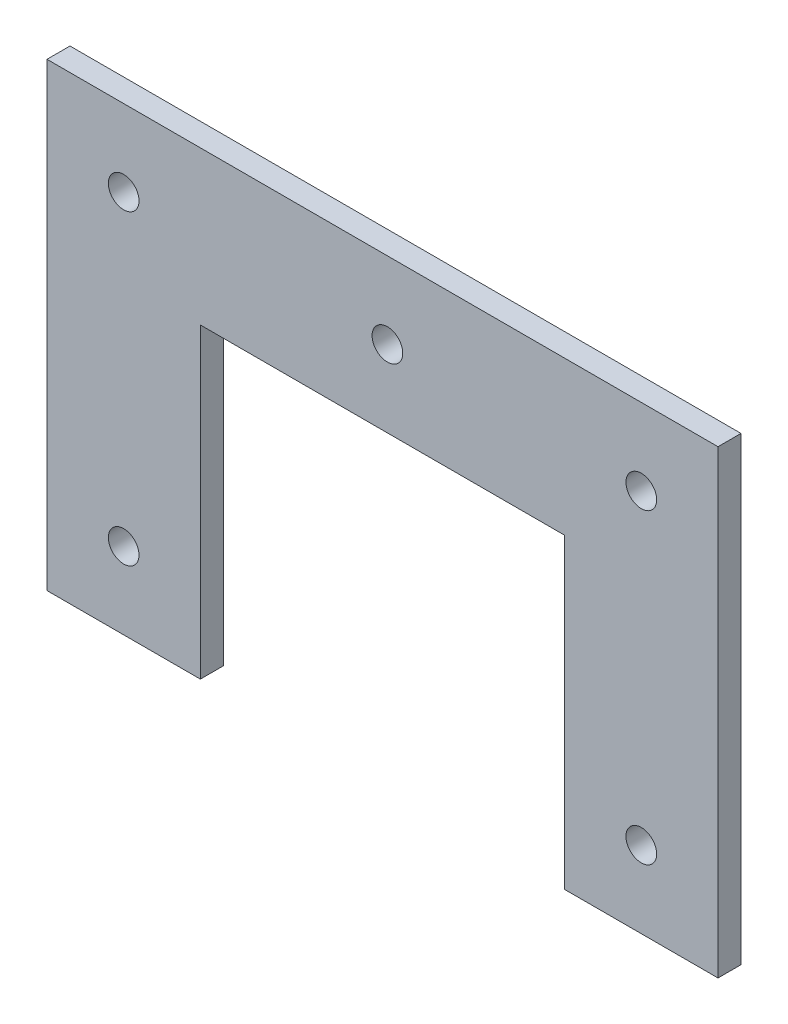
ISO-10303-21;
HEADER;
FILE_DESCRIPTION(('STEP AP214'),'2;1');
FILE_NAME('part.step','',(''),(''),'','','');
FILE_SCHEMA(('AUTOMOTIVE_DESIGN { 1 0 10303 214 1 1 1 1 }'));
ENDSEC;
DATA;
#1=APPLICATION_CONTEXT('core data for automotive mechanical design processes');
#2=APPLICATION_PROTOCOL_DEFINITION('international standard','automotive_design',2000,#1);
#3=PRODUCT_CONTEXT('',#1,'mechanical');
#4=PRODUCT('Part','Part','',(#3));
#5=PRODUCT_RELATED_PRODUCT_CATEGORY('part','',(#4));
#6=PRODUCT_DEFINITION_FORMATION('','',#4);
#7=PRODUCT_DEFINITION_CONTEXT('part definition',#1,'design');
#8=PRODUCT_DEFINITION('design','',#6,#7);
#9=PRODUCT_DEFINITION_SHAPE('','',#8);
#10=(LENGTH_UNIT() NAMED_UNIT(*) SI_UNIT(.MILLI.,.METRE.));
#11=(NAMED_UNIT(*) PLANE_ANGLE_UNIT() SI_UNIT($,.RADIAN.));
#12=(NAMED_UNIT(*) SI_UNIT($,.STERADIAN.) SOLID_ANGLE_UNIT());
#13=UNCERTAINTY_MEASURE_WITH_UNIT(LENGTH_MEASURE(1.E-05),#10,'distance_accuracy_value','');
#14=(GEOMETRIC_REPRESENTATION_CONTEXT(3) GLOBAL_UNCERTAINTY_ASSIGNED_CONTEXT((#13)) GLOBAL_UNIT_ASSIGNED_CONTEXT((#10,
#11,#12)) REPRESENTATION_CONTEXT('',''));
#15=CARTESIAN_POINT('',(0.,0.,0.));
#16=DIRECTION('',(0.,0.,1.));
#17=DIRECTION('',(1.,0.,0.));
#18=AXIS2_PLACEMENT_3D('',#15,#16,#17);
#19=CARTESIAN_POINT('',(-43.75,-30.,3.));
#20=DIRECTION('',(0.,1.,0.));
#21=DIRECTION('',(0.,0.,1.));
#22=AXIS2_PLACEMENT_3D('',#19,#20,#21);
#23=PLANE('',#22);
#24=DIRECTION('',(1.,0.,0.));
#25=VECTOR('',#24,1.);
#26=CARTESIAN_POINT('',(-43.75,-30.,0.));
#27=LINE('',#26,#25);
#28=CARTESIAN_POINT('',(-43.75,-30.,0.));
#29=VERTEX_POINT('',#28);
#30=CARTESIAN_POINT('',(-23.75,-30.,0.));
#31=VERTEX_POINT('',#30);
#32=EDGE_CURVE('E126',#29,#31,#27,.T.);
#33=ORIENTED_EDGE('',*,*,#32,.T.);
#34=DIRECTION('',(0.,0.,1.));
#35=VECTOR('',#34,1.);
#36=CARTESIAN_POINT('',(-23.75,-30.,0.));
#37=LINE('',#36,#35);
#38=CARTESIAN_POINT('',(-23.75,-30.,3.));
#39=VERTEX_POINT('',#38);
#40=EDGE_CURVE('E110',#31,#39,#37,.T.);
#41=ORIENTED_EDGE('',*,*,#40,.T.);
#42=DIRECTION('',(1.,0.,0.));
#43=VECTOR('',#42,1.);
#44=CARTESIAN_POINT('',(-43.75,-30.,3.));
#45=LINE('',#44,#43);
#46=CARTESIAN_POINT('',(-43.75,-30.,3.));
#47=VERTEX_POINT('',#46);
#48=EDGE_CURVE('E143',#47,#39,#45,.T.);
#49=ORIENTED_EDGE('',*,*,#48,.F.);
#50=DIRECTION('',(0.,0.,-1.));
#51=VECTOR('',#50,1.);
#52=CARTESIAN_POINT('',(-43.75,-30.,3.));
#53=LINE('',#52,#51);
#54=EDGE_CURVE('E133',#47,#29,#53,.T.);
#55=ORIENTED_EDGE('',*,*,#54,.T.);
#56=EDGE_LOOP('',(#33,#41,#49,#55));
#57=FACE_BOUND('',#56,.T.);
#58=ADVANCED_FACE('F35',(#57),#23,.F.);
#59=CARTESIAN_POINT('',(43.75,30.,3.));
#60=DIRECTION('',(-1.,0.,0.));
#61=DIRECTION('',(0.,-1.,0.));
#62=AXIS2_PLACEMENT_3D('',#59,#60,#61);
#63=PLANE('',#62);
#64=DIRECTION('',(0.,1.,0.));
#65=VECTOR('',#64,1.);
#66=CARTESIAN_POINT('',(43.75,30.,0.));
#67=LINE('',#66,#65);
#68=CARTESIAN_POINT('',(43.75,-30.,0.));
#69=VERTEX_POINT('',#68);
#70=CARTESIAN_POINT('',(43.75,30.,0.));
#71=VERTEX_POINT('',#70);
#72=EDGE_CURVE('E151',#69,#71,#67,.T.);
#73=ORIENTED_EDGE('',*,*,#72,.T.);
#74=DIRECTION('',(0.,0.,-1.));
#75=VECTOR('',#74,1.);
#76=CARTESIAN_POINT('',(43.75,30.,3.));
#77=LINE('',#76,#75);
#78=CARTESIAN_POINT('',(43.75,30.,3.));
#79=VERTEX_POINT('',#78);
#80=EDGE_CURVE('E11',#79,#71,#77,.T.);
#81=ORIENTED_EDGE('',*,*,#80,.F.);
#82=DIRECTION('',(0.,1.,0.));
#83=VECTOR('',#82,1.);
#84=CARTESIAN_POINT('',(43.75,30.,3.));
#85=LINE('',#84,#83);
#86=CARTESIAN_POINT('',(43.75,-30.,3.));
#87=VERTEX_POINT('',#86);
#88=EDGE_CURVE('E134',#87,#79,#85,.T.);
#89=ORIENTED_EDGE('',*,*,#88,.F.);
#90=DIRECTION('',(0.,0.,-1.));
#91=VECTOR('',#90,1.);
#92=CARTESIAN_POINT('',(43.75,-30.,3.));
#93=LINE('',#92,#91);
#94=EDGE_CURVE('E141',#87,#69,#93,.T.);
#95=ORIENTED_EDGE('',*,*,#94,.T.);
#96=EDGE_LOOP('',(#73,#81,#89,#95));
#97=FACE_BOUND('',#96,.T.);
#98=ADVANCED_FACE('F37',(#97),#63,.F.);
#99=CARTESIAN_POINT('',(-43.75,30.,3.));
#100=DIRECTION('',(0.,-1.,0.));
#101=DIRECTION('',(0.,0.,-1.));
#102=AXIS2_PLACEMENT_3D('',#99,#100,#101);
#103=PLANE('',#102);
#104=DIRECTION('',(-1.,0.,0.));
#105=VECTOR('',#104,1.);
#106=CARTESIAN_POINT('',(-43.75,30.,0.));
#107=LINE('',#106,#105);
#108=CARTESIAN_POINT('',(-43.75,30.,0.));
#109=VERTEX_POINT('',#108);
#110=EDGE_CURVE('E150',#71,#109,#107,.T.);
#111=ORIENTED_EDGE('',*,*,#110,.T.);
#112=DIRECTION('',(0.,0.,-1.));
#113=VECTOR('',#112,1.);
#114=CARTESIAN_POINT('',(-43.75,30.,3.));
#115=LINE('',#114,#113);
#116=CARTESIAN_POINT('',(-43.75,30.,3.));
#117=VERTEX_POINT('',#116);
#118=EDGE_CURVE('E43',#117,#109,#115,.T.);
#119=ORIENTED_EDGE('',*,*,#118,.F.);
#120=DIRECTION('',(-1.,0.,0.));
#121=VECTOR('',#120,1.);
#122=CARTESIAN_POINT('',(-43.75,30.,3.));
#123=LINE('',#122,#121);
#124=EDGE_CURVE('E88',#79,#117,#123,.T.);
#125=ORIENTED_EDGE('',*,*,#124,.F.);
#126=ORIENTED_EDGE('',*,*,#80,.T.);
#127=EDGE_LOOP('',(#111,#119,#125,#126));
#128=FACE_BOUND('',#127,.T.);
#129=ADVANCED_FACE('F220',(#128),#103,.F.);
#130=CARTESIAN_POINT('',(-43.75,30.,3.));
#131=DIRECTION('',(1.,0.,0.));
#132=DIRECTION('',(0.,1.,0.));
#133=AXIS2_PLACEMENT_3D('',#130,#131,#132);
#134=PLANE('',#133);
#135=DIRECTION('',(0.,-1.,0.));
#136=VECTOR('',#135,1.);
#137=CARTESIAN_POINT('',(-43.75,30.,0.));
#138=LINE('',#137,#136);
#139=EDGE_CURVE('E137',#109,#29,#138,.T.);
#140=ORIENTED_EDGE('',*,*,#139,.T.);
#141=ORIENTED_EDGE('',*,*,#54,.F.);
#142=DIRECTION('',(0.,-1.,0.));
#143=VECTOR('',#142,1.);
#144=CARTESIAN_POINT('',(-43.75,30.,3.));
#145=LINE('',#144,#143);
#146=EDGE_CURVE('E148',#117,#47,#145,.T.);
#147=ORIENTED_EDGE('',*,*,#146,.F.);
#148=ORIENTED_EDGE('',*,*,#118,.T.);
#149=EDGE_LOOP('',(#140,#141,#147,#148));
#150=FACE_BOUND('',#149,.T.);
#151=ADVANCED_FACE('F147',(#150),#134,.F.);
#152=CARTESIAN_POINT('',(23.75,-30.,3.));
#153=VERTEX_POINT('',#152);
#154=EDGE_CURVE('E59',#153,#87,#45,.T.);
#155=ORIENTED_EDGE('',*,*,#154,.F.);
#156=DIRECTION('',(0.,0.,1.));
#157=VECTOR('',#156,1.);
#158=CARTESIAN_POINT('',(23.75,-30.,0.));
#159=LINE('',#158,#157);
#160=CARTESIAN_POINT('',(23.75,-30.,0.));
#161=VERTEX_POINT('',#160);
#162=EDGE_CURVE('E120',#161,#153,#159,.T.);
#163=ORIENTED_EDGE('',*,*,#162,.F.);
#164=EDGE_CURVE('E81',#161,#69,#27,.T.);
#165=ORIENTED_EDGE('',*,*,#164,.T.);
#166=ORIENTED_EDGE('',*,*,#94,.F.);
#167=EDGE_LOOP('',(#155,#163,#165,#166));
#168=FACE_BOUND('',#167,.T.);
#169=ADVANCED_FACE('F207',(#168),#23,.F.);
#170=CARTESIAN_POINT('',(0.,0.,3.));
#171=DIRECTION('',(0.,0.,1.));
#172=DIRECTION('',(1.,0.,0.));
#173=AXIS2_PLACEMENT_3D('',#170,#171,#172);
#174=PLANE('',#173);
#175=CARTESIAN_POINT('',(-33.75,-20.,3.));
#176=DIRECTION('',(0.,0.,1.));
#177=DIRECTION('',(1.,0.,0.));
#178=AXIS2_PLACEMENT_3D('',#175,#176,#177);
#179=CIRCLE('',#178,1.99999999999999);
#180=CARTESIAN_POINT('',(-31.75,-20.,3.));
#181=VERTEX_POINT('',#180);
#182=EDGE_CURVE('E198',#181,#181,#179,.T.);
#183=ORIENTED_EDGE('',*,*,#182,.F.);
#184=EDGE_LOOP('',(#183));
#185=FACE_BOUND('',#184,.T.);
#186=CARTESIAN_POINT('',(-33.75,20.,3.));
#187=DIRECTION('',(0.,0.,1.));
#188=DIRECTION('',(1.,0.,0.));
#189=AXIS2_PLACEMENT_3D('',#186,#187,#188);
#190=CIRCLE('',#189,1.99999999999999);
#191=CARTESIAN_POINT('',(-31.75,20.,3.));
#192=VERTEX_POINT('',#191);
#193=EDGE_CURVE('E192',#192,#192,#190,.T.);
#194=ORIENTED_EDGE('',*,*,#193,.F.);
#195=EDGE_LOOP('',(#194));
#196=FACE_BOUND('',#195,.T.);
#197=CARTESIAN_POINT('',(0.640947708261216,20.,3.));
#198=DIRECTION('',(0.,0.,1.));
#199=DIRECTION('',(1.,0.,0.));
#200=AXIS2_PLACEMENT_3D('',#197,#198,#199);
#201=CIRCLE('',#200,1.99999999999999);
#202=CARTESIAN_POINT('',(2.6409477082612,20.,3.));
#203=VERTEX_POINT('',#202);
#204=EDGE_CURVE('E186',#203,#203,#201,.T.);
#205=ORIENTED_EDGE('',*,*,#204,.F.);
#206=EDGE_LOOP('',(#205));
#207=FACE_BOUND('',#206,.T.);
#208=CARTESIAN_POINT('',(33.75,20.,3.));
#209=DIRECTION('',(0.,0.,1.));
#210=DIRECTION('',(1.,0.,0.));
#211=AXIS2_PLACEMENT_3D('',#208,#209,#210);
#212=CIRCLE('',#211,1.99999999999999);
#213=CARTESIAN_POINT('',(35.75,20.,3.));
#214=VERTEX_POINT('',#213);
#215=EDGE_CURVE('E180',#214,#214,#212,.T.);
#216=ORIENTED_EDGE('',*,*,#215,.F.);
#217=EDGE_LOOP('',(#216));
#218=FACE_BOUND('',#217,.T.);
#219=CARTESIAN_POINT('',(33.75,-20.,3.));
#220=DIRECTION('',(0.,0.,1.));
#221=DIRECTION('',(1.,0.,0.));
#222=AXIS2_PLACEMENT_3D('',#219,#220,#221);
#223=CIRCLE('',#222,1.99999999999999);
#224=CARTESIAN_POINT('',(35.75,-20.,3.));
#225=VERTEX_POINT('',#224);
#226=EDGE_CURVE('E174',#225,#225,#223,.T.);
#227=ORIENTED_EDGE('',*,*,#226,.F.);
#228=EDGE_LOOP('',(#227));
#229=FACE_BOUND('',#228,.T.);
#230=DIRECTION('',(0.,-1.,0.));
#231=VECTOR('',#230,1.);
#232=CARTESIAN_POINT('',(-23.75,-30.,3.));
#233=LINE('',#232,#231);
#234=CARTESIAN_POINT('',(-23.75,9.99999999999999,3.));
#235=VERTEX_POINT('',#234);
#236=EDGE_CURVE('E115',#235,#39,#233,.T.);
#237=ORIENTED_EDGE('',*,*,#236,.F.);
#238=DIRECTION('',(-1.,0.,0.));
#239=VECTOR('',#238,1.);
#240=CARTESIAN_POINT('',(-23.75,9.99999999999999,3.));
#241=LINE('',#240,#239);
#242=CARTESIAN_POINT('',(23.75,9.99999999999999,3.));
#243=VERTEX_POINT('',#242);
#244=EDGE_CURVE('E129',#243,#235,#241,.T.);
#245=ORIENTED_EDGE('',*,*,#244,.F.);
#246=DIRECTION('',(0.,1.,0.));
#247=VECTOR('',#246,1.);
#248=CARTESIAN_POINT('',(23.75,-30.,3.));
#249=LINE('',#248,#247);
#250=EDGE_CURVE('E165',#153,#243,#249,.T.);
#251=ORIENTED_EDGE('',*,*,#250,.F.);
#252=ORIENTED_EDGE('',*,*,#154,.T.);
#253=ORIENTED_EDGE('',*,*,#88,.T.);
#254=ORIENTED_EDGE('',*,*,#124,.T.);
#255=ORIENTED_EDGE('',*,*,#146,.T.);
#256=ORIENTED_EDGE('',*,*,#48,.T.);
#257=EDGE_LOOP('',(#237,#245,#251,#252,#253,#254,#255,#256));
#258=FACE_BOUND('',#257,.T.);
#259=ADVANCED_FACE('F204',(#185,#196,#207,#218,#229,#258),#174,.T.);
#260=CARTESIAN_POINT('',(0.,0.,0.));
#261=DIRECTION('',(0.,0.,1.));
#262=DIRECTION('',(1.,0.,0.));
#263=AXIS2_PLACEMENT_3D('',#260,#261,#262);
#264=PLANE('',#263);
#265=CARTESIAN_POINT('',(-33.75,-20.,0.));
#266=DIRECTION('',(0.,0.,1.));
#267=DIRECTION('',(1.,0.,0.));
#268=AXIS2_PLACEMENT_3D('',#265,#266,#267);
#269=CIRCLE('',#268,1.99999999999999);
#270=CARTESIAN_POINT('',(-31.75,-20.,0.));
#271=VERTEX_POINT('',#270);
#272=EDGE_CURVE('E195',#271,#271,#269,.T.);
#273=ORIENTED_EDGE('',*,*,#272,.T.);
#274=EDGE_LOOP('',(#273));
#275=FACE_BOUND('',#274,.T.);
#276=CARTESIAN_POINT('',(-33.75,20.,0.));
#277=DIRECTION('',(0.,0.,1.));
#278=DIRECTION('',(1.,0.,0.));
#279=AXIS2_PLACEMENT_3D('',#276,#277,#278);
#280=CIRCLE('',#279,1.99999999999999);
#281=CARTESIAN_POINT('',(-31.75,20.,0.));
#282=VERTEX_POINT('',#281);
#283=EDGE_CURVE('E189',#282,#282,#280,.T.);
#284=ORIENTED_EDGE('',*,*,#283,.T.);
#285=EDGE_LOOP('',(#284));
#286=FACE_BOUND('',#285,.T.);
#287=CARTESIAN_POINT('',(0.640947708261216,20.,0.));
#288=DIRECTION('',(0.,0.,1.));
#289=DIRECTION('',(1.,0.,0.));
#290=AXIS2_PLACEMENT_3D('',#287,#288,#289);
#291=CIRCLE('',#290,2.);
#292=CARTESIAN_POINT('',(2.64094770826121,20.,0.));
#293=VERTEX_POINT('',#292);
#294=EDGE_CURVE('E183',#293,#293,#291,.T.);
#295=ORIENTED_EDGE('',*,*,#294,.T.);
#296=EDGE_LOOP('',(#295));
#297=FACE_BOUND('',#296,.T.);
#298=CARTESIAN_POINT('',(33.75,20.,0.));
#299=DIRECTION('',(0.,0.,1.));
#300=DIRECTION('',(1.,0.,0.));
#301=AXIS2_PLACEMENT_3D('',#298,#299,#300);
#302=CIRCLE('',#301,1.99999999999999);
#303=CARTESIAN_POINT('',(35.75,20.,0.));
#304=VERTEX_POINT('',#303);
#305=EDGE_CURVE('E177',#304,#304,#302,.T.);
#306=ORIENTED_EDGE('',*,*,#305,.T.);
#307=EDGE_LOOP('',(#306));
#308=FACE_BOUND('',#307,.T.);
#309=CARTESIAN_POINT('',(33.75,-20.,0.));
#310=DIRECTION('',(0.,0.,1.));
#311=DIRECTION('',(1.,0.,0.));
#312=AXIS2_PLACEMENT_3D('',#309,#310,#311);
#313=CIRCLE('',#312,1.99999999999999);
#314=CARTESIAN_POINT('',(35.75,-20.,0.));
#315=VERTEX_POINT('',#314);
#316=EDGE_CURVE('E169',#315,#315,#313,.T.);
#317=ORIENTED_EDGE('',*,*,#316,.T.);
#318=EDGE_LOOP('',(#317));
#319=FACE_BOUND('',#318,.T.);
#320=DIRECTION('',(-1.,0.,0.));
#321=VECTOR('',#320,1.);
#322=CARTESIAN_POINT('',(-23.75,9.99999999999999,0.));
#323=LINE('',#322,#321);
#324=CARTESIAN_POINT('',(23.75,9.99999999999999,0.));
#325=VERTEX_POINT('',#324);
#326=CARTESIAN_POINT('',(-23.75,9.99999999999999,0.));
#327=VERTEX_POINT('',#326);
#328=EDGE_CURVE('E50',#325,#327,#323,.T.);
#329=ORIENTED_EDGE('',*,*,#328,.T.);
#330=DIRECTION('',(0.,-1.,0.));
#331=VECTOR('',#330,1.);
#332=CARTESIAN_POINT('',(-23.75,-30.,0.));
#333=LINE('',#332,#331);
#334=EDGE_CURVE('E113',#327,#31,#333,.T.);
#335=ORIENTED_EDGE('',*,*,#334,.T.);
#336=ORIENTED_EDGE('',*,*,#32,.F.);
#337=ORIENTED_EDGE('',*,*,#139,.F.);
#338=ORIENTED_EDGE('',*,*,#110,.F.);
#339=ORIENTED_EDGE('',*,*,#72,.F.);
#340=ORIENTED_EDGE('',*,*,#164,.F.);
#341=DIRECTION('',(0.,1.,0.));
#342=VECTOR('',#341,1.);
#343=CARTESIAN_POINT('',(23.75,-30.,0.));
#344=LINE('',#343,#342);
#345=EDGE_CURVE('E128',#161,#325,#344,.T.);
#346=ORIENTED_EDGE('',*,*,#345,.T.);
#347=EDGE_LOOP('',(#329,#335,#336,#337,#338,#339,#340,#346));
#348=FACE_BOUND('',#347,.T.);
#349=ADVANCED_FACE('F124',(#275,#286,#297,#308,#319,#348),#264,.F.);
#350=CARTESIAN_POINT('',(-23.75,-30.,0.));
#351=DIRECTION('',(-1.,0.,0.));
#352=DIRECTION('',(0.,0.,1.));
#353=AXIS2_PLACEMENT_3D('',#350,#351,#352);
#354=PLANE('',#353);
#355=ORIENTED_EDGE('',*,*,#236,.T.);
#356=ORIENTED_EDGE('',*,*,#40,.F.);
#357=ORIENTED_EDGE('',*,*,#334,.F.);
#358=DIRECTION('',(0.,0.,1.));
#359=VECTOR('',#358,1.);
#360=CARTESIAN_POINT('',(-23.75,9.99999999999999,0.));
#361=LINE('',#360,#359);
#362=EDGE_CURVE('E153',#327,#235,#361,.T.);
#363=ORIENTED_EDGE('',*,*,#362,.T.);
#364=EDGE_LOOP('',(#355,#356,#357,#363));
#365=FACE_BOUND('',#364,.T.);
#366=ADVANCED_FACE('F112',(#365),#354,.F.);
#367=CARTESIAN_POINT('',(-23.75,9.99999999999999,0.));
#368=DIRECTION('',(0.,1.,0.));
#369=DIRECTION('',(-1.,0.,0.));
#370=AXIS2_PLACEMENT_3D('',#367,#368,#369);
#371=PLANE('',#370);
#372=ORIENTED_EDGE('',*,*,#244,.T.);
#373=ORIENTED_EDGE('',*,*,#362,.F.);
#374=ORIENTED_EDGE('',*,*,#328,.F.);
#375=DIRECTION('',(0.,0.,1.));
#376=VECTOR('',#375,1.);
#377=CARTESIAN_POINT('',(23.75,9.99999999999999,0.));
#378=LINE('',#377,#376);
#379=EDGE_CURVE('E160',#325,#243,#378,.T.);
#380=ORIENTED_EDGE('',*,*,#379,.T.);
#381=EDGE_LOOP('',(#372,#373,#374,#380));
#382=FACE_BOUND('',#381,.T.);
#383=ADVANCED_FACE('F237',(#382),#371,.F.);
#384=CARTESIAN_POINT('',(23.75,-30.,0.));
#385=DIRECTION('',(1.,0.,0.));
#386=DIRECTION('',(0.,0.,-1.));
#387=AXIS2_PLACEMENT_3D('',#384,#385,#386);
#388=PLANE('',#387);
#389=ORIENTED_EDGE('',*,*,#250,.T.);
#390=ORIENTED_EDGE('',*,*,#379,.F.);
#391=ORIENTED_EDGE('',*,*,#345,.F.);
#392=ORIENTED_EDGE('',*,*,#162,.T.);
#393=EDGE_LOOP('',(#389,#390,#391,#392));
#394=FACE_BOUND('',#393,.T.);
#395=ADVANCED_FACE('F236',(#394),#388,.F.);
#396=CARTESIAN_POINT('',(33.75,-20.,3.));
#397=DIRECTION('',(0.,0.,1.));
#398=DIRECTION('',(1.,0.,0.));
#399=AXIS2_PLACEMENT_3D('',#396,#397,#398);
#400=CYLINDRICAL_SURFACE('',#399,1.99999999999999);
#401=ORIENTED_EDGE('',*,*,#316,.F.);
#402=EDGE_LOOP('',(#401));
#403=FACE_BOUND('',#402,.T.);
#404=ORIENTED_EDGE('',*,*,#226,.T.);
#405=EDGE_LOOP('',(#404));
#406=FACE_BOUND('',#405,.T.);
#407=ADVANCED_FACE('F244',(#403,#406),#400,.F.);
#408=CARTESIAN_POINT('',(33.75,20.,3.));
#409=DIRECTION('',(0.,0.,1.));
#410=DIRECTION('',(1.,0.,0.));
#411=AXIS2_PLACEMENT_3D('',#408,#409,#410);
#412=CYLINDRICAL_SURFACE('',#411,1.99999999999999);
#413=ORIENTED_EDGE('',*,*,#305,.F.);
#414=EDGE_LOOP('',(#413));
#415=FACE_BOUND('',#414,.T.);
#416=ORIENTED_EDGE('',*,*,#215,.T.);
#417=EDGE_LOOP('',(#416));
#418=FACE_BOUND('',#417,.T.);
#419=ADVANCED_FACE('F265',(#415,#418),#412,.F.);
#420=CARTESIAN_POINT('',(0.640947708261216,20.,3.));
#421=DIRECTION('',(0.,0.,1.));
#422=DIRECTION('',(1.,0.,0.));
#423=AXIS2_PLACEMENT_3D('',#420,#421,#422);
#424=CYLINDRICAL_SURFACE('',#423,1.99999999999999);
#425=ORIENTED_EDGE('',*,*,#294,.F.);
#426=EDGE_LOOP('',(#425));
#427=FACE_BOUND('',#426,.T.);
#428=ORIENTED_EDGE('',*,*,#204,.T.);
#429=EDGE_LOOP('',(#428));
#430=FACE_BOUND('',#429,.T.);
#431=ADVANCED_FACE('F269',(#427,#430),#424,.F.);
#432=CARTESIAN_POINT('',(-33.75,20.,3.));
#433=DIRECTION('',(0.,0.,1.));
#434=DIRECTION('',(1.,0.,0.));
#435=AXIS2_PLACEMENT_3D('',#432,#433,#434);
#436=CYLINDRICAL_SURFACE('',#435,1.99999999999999);
#437=ORIENTED_EDGE('',*,*,#283,.F.);
#438=EDGE_LOOP('',(#437));
#439=FACE_BOUND('',#438,.T.);
#440=ORIENTED_EDGE('',*,*,#193,.T.);
#441=EDGE_LOOP('',(#440));
#442=FACE_BOUND('',#441,.T.);
#443=ADVANCED_FACE('F274',(#439,#442),#436,.F.);
#444=CARTESIAN_POINT('',(-33.75,-20.,3.));
#445=DIRECTION('',(0.,0.,1.));
#446=DIRECTION('',(1.,0.,0.));
#447=AXIS2_PLACEMENT_3D('',#444,#445,#446);
#448=CYLINDRICAL_SURFACE('',#447,1.99999999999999);
#449=ORIENTED_EDGE('',*,*,#272,.F.);
#450=EDGE_LOOP('',(#449));
#451=FACE_BOUND('',#450,.T.);
#452=ORIENTED_EDGE('',*,*,#182,.T.);
#453=EDGE_LOOP('',(#452));
#454=FACE_BOUND('',#453,.T.);
#455=ADVANCED_FACE('F202',(#451,#454),#448,.F.);
#456=CLOSED_SHELL('',(#58,#98,#129,#151,#169,#259,#349,#366,#383,#395,#407,#419,#431,#443,#455));
#457=MANIFOLD_SOLID_BREP('B2',#456);
#458=ADVANCED_BREP_SHAPE_REPRESENTATION('',(#18,#457),#14);
#459=SHAPE_DEFINITION_REPRESENTATION(#9,#458);
ENDSEC;
END-ISO-10303-21;
